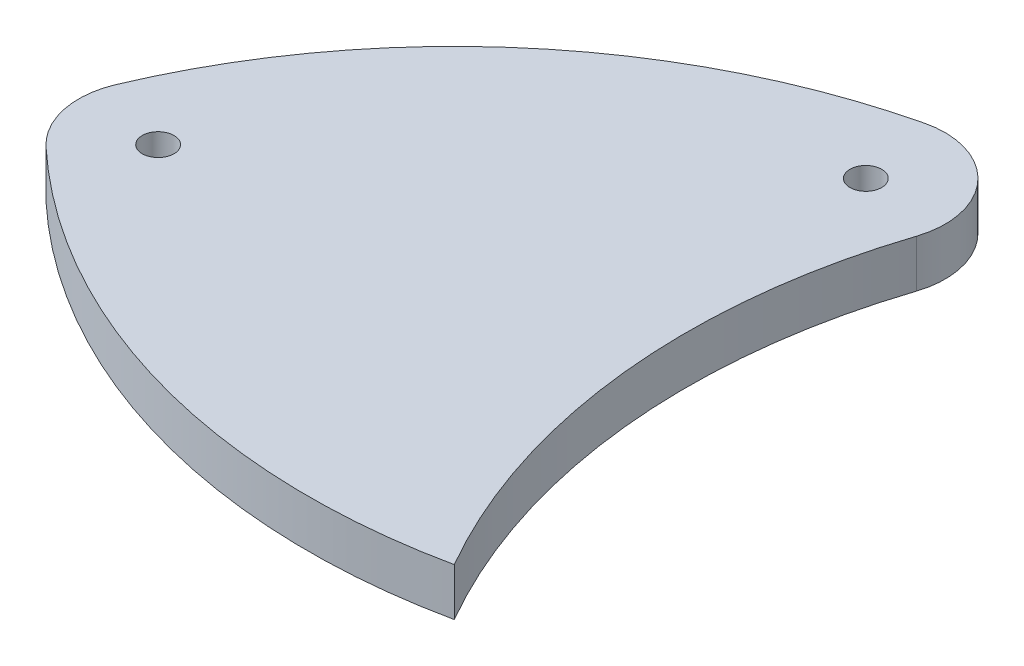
ISO-10303-21;
HEADER;
FILE_DESCRIPTION(('STEP AP214'),'2;1');
FILE_NAME('part.step','',(''),(''),'','','');
FILE_SCHEMA(('AUTOMOTIVE_DESIGN { 1 0 10303 214 1 1 1 1 }'));
ENDSEC;
DATA;
#1=APPLICATION_CONTEXT('core data for automotive mechanical design processes');
#2=APPLICATION_PROTOCOL_DEFINITION('international standard','automotive_design',2000,#1);
#3=PRODUCT_CONTEXT('',#1,'mechanical');
#4=PRODUCT('Part','Part','',(#3));
#5=PRODUCT_RELATED_PRODUCT_CATEGORY('part','',(#4));
#6=PRODUCT_DEFINITION_FORMATION('','',#4);
#7=PRODUCT_DEFINITION_CONTEXT('part definition',#1,'design');
#8=PRODUCT_DEFINITION('design','',#6,#7);
#9=PRODUCT_DEFINITION_SHAPE('','',#8);
#10=(LENGTH_UNIT() NAMED_UNIT(*) SI_UNIT(.MILLI.,.METRE.));
#11=(NAMED_UNIT(*) PLANE_ANGLE_UNIT() SI_UNIT($,.RADIAN.));
#12=(NAMED_UNIT(*) SI_UNIT($,.STERADIAN.) SOLID_ANGLE_UNIT());
#13=UNCERTAINTY_MEASURE_WITH_UNIT(LENGTH_MEASURE(1.E-05),#10,'distance_accuracy_value','');
#14=(GEOMETRIC_REPRESENTATION_CONTEXT(3) GLOBAL_UNCERTAINTY_ASSIGNED_CONTEXT((#13)) GLOBAL_UNIT_ASSIGNED_CONTEXT((#10,
#11,#12)) REPRESENTATION_CONTEXT('',''));
#15=CARTESIAN_POINT('',(0.,0.,0.));
#16=DIRECTION('',(0.,0.,1.));
#17=DIRECTION('',(1.,0.,0.));
#18=AXIS2_PLACEMENT_3D('',#15,#16,#17);
#19=CARTESIAN_POINT('',(-20.2849261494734,3.,-26.3585236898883));
#20=DIRECTION('',(0.,-1.,0.));
#21=DIRECTION('',(0.,0.,-1.));
#22=AXIS2_PLACEMENT_3D('',#19,#20,#21);
#23=PLANE('',#22);
#24=CARTESIAN_POINT('',(-32.2533846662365,3.,-13.5911433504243));
#25=DIRECTION('',(0.,1.,0.));
#26=DIRECTION('',(0.,0.,1.));
#27=AXIS2_PLACEMENT_3D('',#24,#25,#26);
#28=CIRCLE('',#27,0.999999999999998);
#29=CARTESIAN_POINT('',(-32.2533846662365,3.,-12.5911433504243));
#30=VERTEX_POINT('',#29);
#31=EDGE_CURVE('E111',#30,#30,#28,.T.);
#32=ORIENTED_EDGE('',*,*,#31,.F.);
#33=EDGE_LOOP('',(#32));
#34=FACE_BOUND('',#33,.T.);
#35=CARTESIAN_POINT('',(-8.31646763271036,3.,-39.1259040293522));
#36=DIRECTION('',(0.,1.,0.));
#37=DIRECTION('',(0.,0.,-1.));
#38=AXIS2_PLACEMENT_3D('',#35,#36,#37);
#39=CIRCLE('',#38,40.0000000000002);
#40=CARTESIAN_POINT('',(-35.6729442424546,3.,-9.94332039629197));
#41=VERTEX_POINT('',#40);
#42=CARTESIAN_POINT('',(0.,3.,0.));
#43=VERTEX_POINT('',#42);
#44=EDGE_CURVE('E116',#41,#43,#39,.T.);
#45=ORIENTED_EDGE('',*,*,#44,.T.);
#46=CARTESIAN_POINT('',(34.6410161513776,3.,-20.));
#47=DIRECTION('',(0.,-1.,0.));
#48=DIRECTION('',(0.,0.,-1.));
#49=AXIS2_PLACEMENT_3D('',#46,#47,#48);
#50=CIRCLE('',#49,40.);
#51=CARTESIAN_POINT('',(-3.36011446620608,3.,-32.4865556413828));
#52=VERTEX_POINT('',#51);
#53=EDGE_CURVE('E83',#43,#52,#50,.T.);
#54=ORIENTED_EDGE('',*,*,#53,.T.);
#55=CARTESIAN_POINT('',(-8.11025579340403,3.,-34.0473750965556));
#56=DIRECTION('',(0.,1.,0.));
#57=DIRECTION('',(0.,0.,1.));
#58=AXIS2_PLACEMENT_3D('',#55,#56,#57);
#59=CIRCLE('',#58,5.);
#60=CARTESIAN_POINT('',(-9.26886376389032,3.,-38.911285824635));
#61=VERTEX_POINT('',#60);
#62=EDGE_CURVE('E87',#52,#61,#59,.T.);
#63=ORIENTED_EDGE('',*,*,#62,.T.);
#64=CARTESIAN_POINT('',(3.85108611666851E-13,3.,5.34294830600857E-13));
#65=DIRECTION('',(0.,1.,0.));
#66=DIRECTION('',(0.,0.,-1.));
#67=AXIS2_PLACEMENT_3D('',#64,#65,#66);
#68=CIRCLE('',#67,40.0000000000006);
#69=CARTESIAN_POINT('',(-36.8610110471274,3.,-15.5327352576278));
#70=VERTEX_POINT('',#69);
#71=EDGE_CURVE('E91',#61,#70,#68,.T.);
#72=ORIENTED_EDGE('',*,*,#71,.T.);
#73=CARTESIAN_POINT('',(-32.2533846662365,3.,-13.5911433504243));
#74=DIRECTION('',(0.,1.,0.));
#75=DIRECTION('',(0.,0.,-1.));
#76=AXIS2_PLACEMENT_3D('',#73,#74,#75);
#77=CIRCLE('',#76,5.);
#78=EDGE_CURVE('E49',#70,#41,#77,.T.);
#79=ORIENTED_EDGE('',*,*,#78,.T.);
#80=EDGE_LOOP('',(#45,#54,#63,#72,#79));
#81=FACE_BOUND('',#80,.T.);
#82=CARTESIAN_POINT('',(-8.11025579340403,3.,-34.0473750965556));
#83=DIRECTION('',(0.,1.,0.));
#84=DIRECTION('',(0.,0.,1.));
#85=AXIS2_PLACEMENT_3D('',#82,#83,#84);
#86=CIRCLE('',#85,1.);
#87=CARTESIAN_POINT('',(-8.11025579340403,3.,-33.0473750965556));
#88=VERTEX_POINT('',#87);
#89=EDGE_CURVE('E154',#88,#88,#86,.T.);
#90=ORIENTED_EDGE('',*,*,#89,.F.);
#91=EDGE_LOOP('',(#90));
#92=FACE_BOUND('',#91,.T.);
#93=ADVANCED_FACE('F32',(#34,#81,#92),#23,.F.);
#94=CARTESIAN_POINT('',(-20.2849261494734,0.,-26.3585236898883));
#95=DIRECTION('',(0.,-1.,0.));
#96=DIRECTION('',(0.,0.,-1.));
#97=AXIS2_PLACEMENT_3D('',#94,#95,#96);
#98=PLANE('',#97);
#99=CARTESIAN_POINT('',(-32.2533846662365,0.,-13.5911433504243));
#100=DIRECTION('',(0.,1.,0.));
#101=DIRECTION('',(0.,0.,1.));
#102=AXIS2_PLACEMENT_3D('',#99,#100,#101);
#103=CIRCLE('',#102,0.999999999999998);
#104=CARTESIAN_POINT('',(-32.2533846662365,0.,-12.5911433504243));
#105=VERTEX_POINT('',#104);
#106=EDGE_CURVE('E159',#105,#105,#103,.T.);
#107=ORIENTED_EDGE('',*,*,#106,.T.);
#108=EDGE_LOOP('',(#107));
#109=FACE_BOUND('',#108,.T.);
#110=CARTESIAN_POINT('',(-8.31646763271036,0.,-39.1259040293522));
#111=DIRECTION('',(0.,1.,0.));
#112=DIRECTION('',(0.,0.,-1.));
#113=AXIS2_PLACEMENT_3D('',#110,#111,#112);
#114=CIRCLE('',#113,40.0000000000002);
#115=CARTESIAN_POINT('',(-35.6729442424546,0.,-9.94332039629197));
#116=VERTEX_POINT('',#115);
#117=CARTESIAN_POINT('',(0.,0.,0.));
#118=VERTEX_POINT('',#117);
#119=EDGE_CURVE('E107',#116,#118,#114,.T.);
#120=ORIENTED_EDGE('',*,*,#119,.F.);
#121=CARTESIAN_POINT('',(-32.2533846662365,0.,-13.5911433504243));
#122=DIRECTION('',(0.,1.,0.));
#123=DIRECTION('',(0.,0.,-1.));
#124=AXIS2_PLACEMENT_3D('',#121,#122,#123);
#125=CIRCLE('',#124,5.);
#126=CARTESIAN_POINT('',(-36.8610110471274,0.,-15.5327352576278));
#127=VERTEX_POINT('',#126);
#128=EDGE_CURVE('E75',#127,#116,#125,.T.);
#129=ORIENTED_EDGE('',*,*,#128,.F.);
#130=CARTESIAN_POINT('',(3.85108611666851E-13,0.,5.34294830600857E-13));
#131=DIRECTION('',(0.,1.,0.));
#132=DIRECTION('',(0.,0.,-1.));
#133=AXIS2_PLACEMENT_3D('',#130,#131,#132);
#134=CIRCLE('',#133,40.0000000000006);
#135=CARTESIAN_POINT('',(-9.26886376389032,0.,-38.911285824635));
#136=VERTEX_POINT('',#135);
#137=EDGE_CURVE('E69',#136,#127,#134,.T.);
#138=ORIENTED_EDGE('',*,*,#137,.F.);
#139=CARTESIAN_POINT('',(-8.11025579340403,0.,-34.0473750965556));
#140=DIRECTION('',(0.,1.,0.));
#141=DIRECTION('',(0.,0.,1.));
#142=AXIS2_PLACEMENT_3D('',#139,#140,#141);
#143=CIRCLE('',#142,5.);
#144=CARTESIAN_POINT('',(-3.36011446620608,0.,-32.4865556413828));
#145=VERTEX_POINT('',#144);
#146=EDGE_CURVE('E98',#145,#136,#143,.T.);
#147=ORIENTED_EDGE('',*,*,#146,.F.);
#148=CARTESIAN_POINT('',(34.6410161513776,0.,-20.));
#149=DIRECTION('',(0.,-1.,0.));
#150=DIRECTION('',(0.,0.,-1.));
#151=AXIS2_PLACEMENT_3D('',#148,#149,#150);
#152=CIRCLE('',#151,40.);
#153=EDGE_CURVE('E110',#118,#145,#152,.T.);
#154=ORIENTED_EDGE('',*,*,#153,.F.);
#155=EDGE_LOOP('',(#120,#129,#138,#147,#154));
#156=FACE_BOUND('',#155,.T.);
#157=CARTESIAN_POINT('',(-8.11025579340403,0.,-34.0473750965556));
#158=DIRECTION('',(0.,1.,0.));
#159=DIRECTION('',(0.,0.,1.));
#160=AXIS2_PLACEMENT_3D('',#157,#158,#159);
#161=CIRCLE('',#160,1.);
#162=CARTESIAN_POINT('',(-8.11025579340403,0.,-33.0473750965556));
#163=VERTEX_POINT('',#162);
#164=EDGE_CURVE('E157',#163,#163,#161,.T.);
#165=ORIENTED_EDGE('',*,*,#164,.T.);
#166=EDGE_LOOP('',(#165));
#167=FACE_BOUND('',#166,.T.);
#168=ADVANCED_FACE('F120',(#109,#156,#167),#98,.T.);
#169=CARTESIAN_POINT('',(-8.31646763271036,3.,-39.1259040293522));
#170=DIRECTION('',(0.,-1.,0.));
#171=DIRECTION('',(0.,0.,-1.));
#172=AXIS2_PLACEMENT_3D('',#169,#170,#171);
#173=CYLINDRICAL_SURFACE('',#172,40.0000000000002);
#174=ORIENTED_EDGE('',*,*,#119,.T.);
#175=DIRECTION('',(0.,-1.,0.));
#176=VECTOR('',#175,1.);
#177=CARTESIAN_POINT('',(0.,3.,0.));
#178=LINE('',#177,#176);
#179=EDGE_CURVE('E11',#43,#118,#178,.T.);
#180=ORIENTED_EDGE('',*,*,#179,.F.);
#181=ORIENTED_EDGE('',*,*,#44,.F.);
#182=DIRECTION('',(0.,-1.,0.));
#183=VECTOR('',#182,1.);
#184=CARTESIAN_POINT('',(-35.6729442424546,3.,-9.94332039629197));
#185=LINE('',#184,#183);
#186=EDGE_CURVE('E103',#41,#116,#185,.T.);
#187=ORIENTED_EDGE('',*,*,#186,.T.);
#188=EDGE_LOOP('',(#174,#180,#181,#187));
#189=FACE_BOUND('',#188,.T.);
#190=ADVANCED_FACE('F34',(#189),#173,.T.);
#191=CARTESIAN_POINT('',(34.6410161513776,3.,-20.));
#192=DIRECTION('',(0.,-1.,0.));
#193=DIRECTION('',(0.,0.,-1.));
#194=AXIS2_PLACEMENT_3D('',#191,#192,#193);
#195=CYLINDRICAL_SURFACE('',#194,40.);
#196=ORIENTED_EDGE('',*,*,#153,.T.);
#197=DIRECTION('',(0.,-1.,0.));
#198=VECTOR('',#197,1.);
#199=CARTESIAN_POINT('',(-3.36011446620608,3.,-32.4865556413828));
#200=LINE('',#199,#198);
#201=EDGE_CURVE('E41',#52,#145,#200,.T.);
#202=ORIENTED_EDGE('',*,*,#201,.F.);
#203=ORIENTED_EDGE('',*,*,#53,.F.);
#204=ORIENTED_EDGE('',*,*,#179,.T.);
#205=EDGE_LOOP('',(#196,#202,#203,#204));
#206=FACE_BOUND('',#205,.T.);
#207=ADVANCED_FACE('F191',(#206),#195,.F.);
#208=CARTESIAN_POINT('',(-8.11025579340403,3.,-34.0473750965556));
#209=DIRECTION('',(0.,-1.,0.));
#210=DIRECTION('',(0.,0.,-1.));
#211=AXIS2_PLACEMENT_3D('',#208,#209,#210);
#212=CYLINDRICAL_SURFACE('',#211,5.);
#213=ORIENTED_EDGE('',*,*,#146,.T.);
#214=DIRECTION('',(0.,-1.,0.));
#215=VECTOR('',#214,1.);
#216=CARTESIAN_POINT('',(-9.26886376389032,3.,-38.911285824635));
#217=LINE('',#216,#215);
#218=EDGE_CURVE('E95',#61,#136,#217,.T.);
#219=ORIENTED_EDGE('',*,*,#218,.F.);
#220=ORIENTED_EDGE('',*,*,#62,.F.);
#221=ORIENTED_EDGE('',*,*,#201,.T.);
#222=EDGE_LOOP('',(#213,#219,#220,#221));
#223=FACE_BOUND('',#222,.T.);
#224=ADVANCED_FACE('F96',(#223),#212,.T.);
#225=CARTESIAN_POINT('',(3.85108611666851E-13,3.,5.34294830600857E-13));
#226=DIRECTION('',(0.,-1.,0.));
#227=DIRECTION('',(0.,0.,-1.));
#228=AXIS2_PLACEMENT_3D('',#225,#226,#227);
#229=CYLINDRICAL_SURFACE('',#228,40.0000000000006);
#230=ORIENTED_EDGE('',*,*,#137,.T.);
#231=DIRECTION('',(0.,-1.,0.));
#232=VECTOR('',#231,1.);
#233=CARTESIAN_POINT('',(-36.8610110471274,3.,-15.5327352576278));
#234=LINE('',#233,#232);
#235=EDGE_CURVE('E99',#70,#127,#234,.T.);
#236=ORIENTED_EDGE('',*,*,#235,.F.);
#237=ORIENTED_EDGE('',*,*,#71,.F.);
#238=ORIENTED_EDGE('',*,*,#218,.T.);
#239=EDGE_LOOP('',(#230,#236,#237,#238));
#240=FACE_BOUND('',#239,.T.);
#241=ADVANCED_FACE('F101',(#240),#229,.T.);
#242=CARTESIAN_POINT('',(-32.2533846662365,3.,-13.5911433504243));
#243=DIRECTION('',(0.,-1.,0.));
#244=DIRECTION('',(0.,0.,-1.));
#245=AXIS2_PLACEMENT_3D('',#242,#243,#244);
#246=CYLINDRICAL_SURFACE('',#245,5.);
#247=ORIENTED_EDGE('',*,*,#128,.T.);
#248=ORIENTED_EDGE('',*,*,#186,.F.);
#249=ORIENTED_EDGE('',*,*,#78,.F.);
#250=ORIENTED_EDGE('',*,*,#235,.T.);
#251=EDGE_LOOP('',(#247,#248,#249,#250));
#252=FACE_BOUND('',#251,.T.);
#253=ADVANCED_FACE('F125',(#252),#246,.T.);
#254=CARTESIAN_POINT('',(-32.2533846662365,3.,-13.5911433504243));
#255=DIRECTION('',(0.,-1.,0.));
#256=DIRECTION('',(0.,0.,-1.));
#257=AXIS2_PLACEMENT_3D('',#254,#255,#256);
#258=CYLINDRICAL_SURFACE('',#257,0.999999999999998);
#259=ORIENTED_EDGE('',*,*,#31,.T.);
#260=EDGE_LOOP('',(#259));
#261=FACE_BOUND('',#260,.T.);
#262=ORIENTED_EDGE('',*,*,#106,.F.);
#263=EDGE_LOOP('',(#262));
#264=FACE_BOUND('',#263,.T.);
#265=ADVANCED_FACE('F127',(#261,#264),#258,.F.);
#266=CARTESIAN_POINT('',(-8.11025579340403,3.,-34.0473750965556));
#267=DIRECTION('',(0.,-1.,0.));
#268=DIRECTION('',(0.,0.,-1.));
#269=AXIS2_PLACEMENT_3D('',#266,#267,#268);
#270=CYLINDRICAL_SURFACE('',#269,1.);
#271=ORIENTED_EDGE('',*,*,#89,.T.);
#272=EDGE_LOOP('',(#271));
#273=FACE_BOUND('',#272,.T.);
#274=ORIENTED_EDGE('',*,*,#164,.F.);
#275=EDGE_LOOP('',(#274));
#276=FACE_BOUND('',#275,.T.);
#277=ADVANCED_FACE('F133',(#273,#276),#270,.F.);
#278=CLOSED_SHELL('',(#93,#168,#190,#207,#224,#241,#253,#265,#277));
#279=MANIFOLD_SOLID_BREP('B2',#278);
#280=ADVANCED_BREP_SHAPE_REPRESENTATION('',(#18,#279),#14);
#281=SHAPE_DEFINITION_REPRESENTATION(#9,#280);
ENDSEC;
END-ISO-10303-21;
